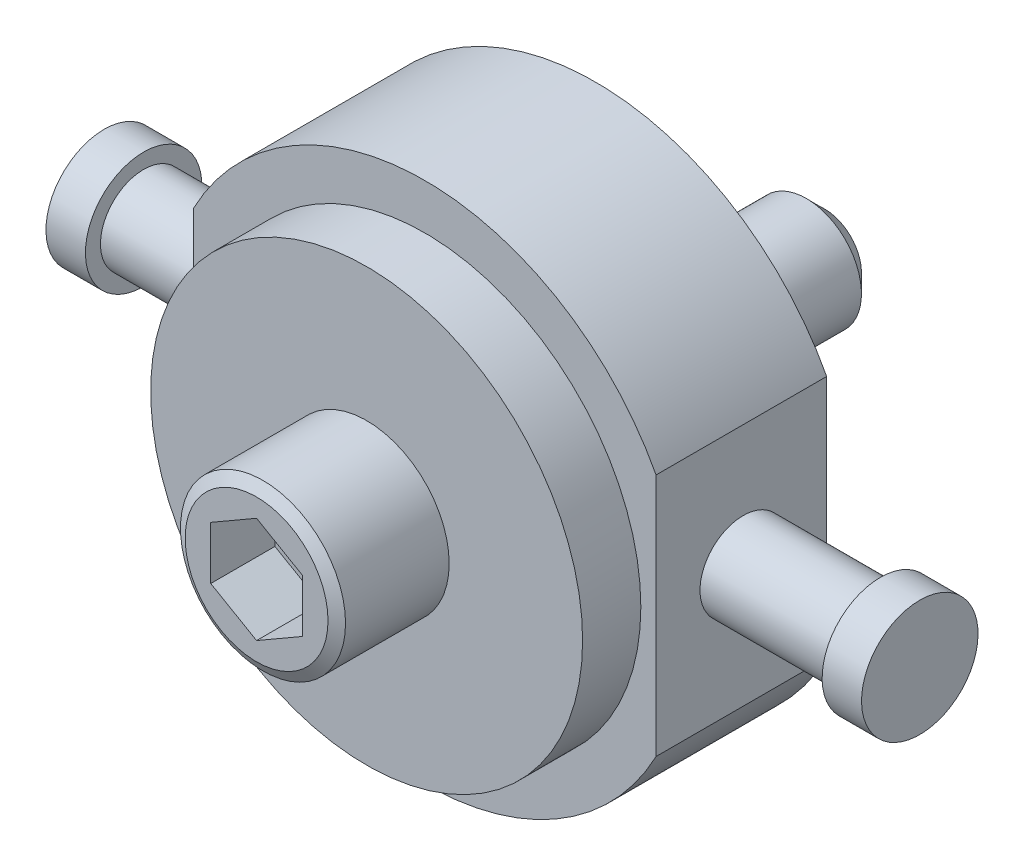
ISO-10303-21;
HEADER;
FILE_DESCRIPTION(('STEP AP214'),'2;1');
FILE_NAME('part.step','',(''),(''),'','','');
FILE_SCHEMA(('AUTOMOTIVE_DESIGN { 1 0 10303 214 1 1 1 1 }'));
ENDSEC;
DATA;
#1=APPLICATION_CONTEXT('core data for automotive mechanical design processes');
#2=APPLICATION_PROTOCOL_DEFINITION('international standard','automotive_design',2000,#1);
#3=PRODUCT_CONTEXT('',#1,'mechanical');
#4=PRODUCT('Part','Part','',(#3));
#5=PRODUCT_RELATED_PRODUCT_CATEGORY('part','',(#4));
#6=PRODUCT_DEFINITION_FORMATION('','',#4);
#7=PRODUCT_DEFINITION_CONTEXT('part definition',#1,'design');
#8=PRODUCT_DEFINITION('design','',#6,#7);
#9=PRODUCT_DEFINITION_SHAPE('','',#8);
#10=(LENGTH_UNIT() NAMED_UNIT(*) SI_UNIT(.MILLI.,.METRE.));
#11=(NAMED_UNIT(*) PLANE_ANGLE_UNIT() SI_UNIT($,.RADIAN.));
#12=(NAMED_UNIT(*) SI_UNIT($,.STERADIAN.) SOLID_ANGLE_UNIT());
#13=UNCERTAINTY_MEASURE_WITH_UNIT(LENGTH_MEASURE(1.E-05),#10,'distance_accuracy_value','');
#14=(GEOMETRIC_REPRESENTATION_CONTEXT(3) GLOBAL_UNCERTAINTY_ASSIGNED_CONTEXT((#13)) GLOBAL_UNIT_ASSIGNED_CONTEXT((#10,
#11,#12)) REPRESENTATION_CONTEXT('',''));
#15=CARTESIAN_POINT('',(0.,0.,0.));
#16=DIRECTION('',(0.,0.,1.));
#17=DIRECTION('',(1.,0.,0.));
#18=AXIS2_PLACEMENT_3D('',#15,#16,#17);
#19=CARTESIAN_POINT('',(0.,0.,0.));
#20=DIRECTION('',(0.,0.,1.));
#21=DIRECTION('',(1.,0.,0.));
#22=AXIS2_PLACEMENT_3D('',#19,#20,#21);
#23=PLANE('',#22);
#24=CARTESIAN_POINT('',(0.,0.,0.));
#25=DIRECTION('',(0.,0.,1.));
#26=DIRECTION('',(1.,0.,0.));
#27=AXIS2_PLACEMENT_3D('',#24,#25,#26);
#28=CIRCLE('',#27,18.9);
#29=CARTESIAN_POINT('',(18.9,0.,0.));
#30=VERTEX_POINT('',#29);
#31=EDGE_CURVE('E190',#30,#30,#28,.T.);
#32=ORIENTED_EDGE('',*,*,#31,.F.);
#33=EDGE_LOOP('',(#32));
#34=FACE_BOUND('',#33,.T.);
#35=CARTESIAN_POINT('',(0.,0.,0.));
#36=DIRECTION('',(0.,0.,-1.));
#37=DIRECTION('',(-1.,0.,0.));
#38=AXIS2_PLACEMENT_3D('',#35,#36,#37);
#39=CIRCLE('',#38,6.);
#40=CARTESIAN_POINT('',(-6.,0.,0.));
#41=VERTEX_POINT('',#40);
#42=EDGE_CURVE('E137',#41,#41,#39,.T.);
#43=ORIENTED_EDGE('',*,*,#42,.F.);
#44=EDGE_LOOP('',(#43));
#45=FACE_BOUND('',#44,.T.);
#46=ADVANCED_FACE('F14',(#34,#45),#23,.F.);
#47=CARTESIAN_POINT('',(40.165,0.,15.1));
#48=DIRECTION('',(1.,0.,0.));
#49=DIRECTION('',(0.,1.,0.));
#50=AXIS2_PLACEMENT_3D('',#47,#48,#49);
#51=PLANE('',#50);
#52=CARTESIAN_POINT('',(40.165,0.,15.1));
#53=DIRECTION('',(1.,0.,0.));
#54=DIRECTION('',(0.,0.,-1.));
#55=AXIS2_PLACEMENT_3D('',#52,#53,#54);
#56=CIRCLE('',#55,4.71);
#57=CARTESIAN_POINT('',(40.165,0.,10.39));
#58=VERTEX_POINT('',#57);
#59=EDGE_CURVE('E162',#58,#58,#56,.F.);
#60=ORIENTED_EDGE('',*,*,#59,.F.);
#61=EDGE_LOOP('',(#60));
#62=FACE_BOUND('',#61,.T.);
#63=CARTESIAN_POINT('',(40.165,0.,15.1));
#64=DIRECTION('',(1.,0.,0.));
#65=DIRECTION('',(0.,1.,0.));
#66=AXIS2_PLACEMENT_3D('',#63,#64,#65);
#67=CIRCLE('',#66,6.35);
#68=CARTESIAN_POINT('',(40.165,6.35,15.1));
#69=VERTEX_POINT('',#68);
#70=EDGE_CURVE('E9',#69,#69,#67,.T.);
#71=ORIENTED_EDGE('',*,*,#70,.F.);
#72=EDGE_LOOP('',(#71));
#73=FACE_BOUND('',#72,.T.);
#74=ADVANCED_FACE('F234',(#62,#73),#51,.F.);
#75=CARTESIAN_POINT('',(-40.165,0.,15.1));
#76=DIRECTION('',(1.,0.,0.));
#77=DIRECTION('',(0.,1.,0.));
#78=AXIS2_PLACEMENT_3D('',#75,#76,#77);
#79=PLANE('',#78);
#80=CARTESIAN_POINT('',(-40.165,0.,15.1));
#81=DIRECTION('',(1.,0.,0.));
#82=DIRECTION('',(0.,0.,-1.));
#83=AXIS2_PLACEMENT_3D('',#80,#81,#82);
#84=CIRCLE('',#83,4.71);
#85=CARTESIAN_POINT('',(-40.165,0.,10.39));
#86=VERTEX_POINT('',#85);
#87=EDGE_CURVE('E149',#86,#86,#84,.T.);
#88=ORIENTED_EDGE('',*,*,#87,.F.);
#89=EDGE_LOOP('',(#88));
#90=FACE_BOUND('',#89,.T.);
#91=CARTESIAN_POINT('',(-40.165,0.,15.1));
#92=DIRECTION('',(1.,0.,0.));
#93=DIRECTION('',(0.,1.,0.));
#94=AXIS2_PLACEMENT_3D('',#91,#92,#93);
#95=CIRCLE('',#94,6.35);
#96=CARTESIAN_POINT('',(-40.165,6.35,15.1));
#97=VERTEX_POINT('',#96);
#98=EDGE_CURVE('E200',#97,#97,#95,.T.);
#99=ORIENTED_EDGE('',*,*,#98,.T.);
#100=EDGE_LOOP('',(#99));
#101=FACE_BOUND('',#100,.T.);
#102=ADVANCED_FACE('F240',(#90,#101),#79,.T.);
#103=CARTESIAN_POINT('',(0.,0.,42.95));
#104=DIRECTION('',(0.,0.,-1.));
#105=DIRECTION('',(-1.,0.,0.));
#106=AXIS2_PLACEMENT_3D('',#103,#104,#105);
#107=CYLINDRICAL_SURFACE('',#106,9.);
#108=CARTESIAN_POINT('',(0.,0.,42.25));
#109=DIRECTION('',(0.,0.,1.));
#110=DIRECTION('',(1.,0.,0.));
#111=AXIS2_PLACEMENT_3D('',#108,#109,#110);
#112=CIRCLE('',#111,9.);
#113=CARTESIAN_POINT('',(9.,0.,42.25));
#114=VERTEX_POINT('',#113);
#115=EDGE_CURVE('E146',#114,#114,#112,.F.);
#116=ORIENTED_EDGE('',*,*,#115,.T.);
#117=EDGE_LOOP('',(#116));
#118=FACE_BOUND('',#117,.T.);
#119=CARTESIAN_POINT('',(0.,0.,30.95));
#120=DIRECTION('',(0.,0.,1.));
#121=DIRECTION('',(1.,0.,0.));
#122=AXIS2_PLACEMENT_3D('',#119,#120,#121);
#123=CIRCLE('',#122,9.);
#124=CARTESIAN_POINT('',(9.,0.,30.95));
#125=VERTEX_POINT('',#124);
#126=EDGE_CURVE('E142',#125,#125,#123,.T.);
#127=ORIENTED_EDGE('',*,*,#126,.T.);
#128=EDGE_LOOP('',(#127));
#129=FACE_BOUND('',#128,.T.);
#130=ADVANCED_FACE('F215',(#118,#129),#107,.T.);
#131=CARTESIAN_POINT('',(0.,0.,30.95));
#132=DIRECTION('',(0.,0.,-1.));
#133=DIRECTION('',(-1.,0.,0.));
#134=AXIS2_PLACEMENT_3D('',#131,#132,#133);
#135=CYLINDRICAL_SURFACE('',#134,23.55);
#136=CARTESIAN_POINT('',(0.,0.,30.95));
#137=DIRECTION('',(0.,0.,1.));
#138=DIRECTION('',(1.,0.,0.));
#139=AXIS2_PLACEMENT_3D('',#136,#137,#138);
#140=CIRCLE('',#139,23.55);
#141=CARTESIAN_POINT('',(23.55,0.,30.95));
#142=VERTEX_POINT('',#141);
#143=EDGE_CURVE('E150',#142,#142,#140,.T.);
#144=ORIENTED_EDGE('',*,*,#143,.F.);
#145=EDGE_LOOP('',(#144));
#146=FACE_BOUND('',#145,.T.);
#147=CARTESIAN_POINT('',(0.,0.,24.6));
#148=DIRECTION('',(0.,0.,1.));
#149=DIRECTION('',(1.,0.,0.));
#150=AXIS2_PLACEMENT_3D('',#147,#148,#149);
#151=CIRCLE('',#150,23.55);
#152=CARTESIAN_POINT('',(23.55,0.,24.6));
#153=VERTEX_POINT('',#152);
#154=EDGE_CURVE('E145',#153,#153,#151,.T.);
#155=ORIENTED_EDGE('',*,*,#154,.T.);
#156=EDGE_LOOP('',(#155));
#157=FACE_BOUND('',#156,.T.);
#158=ADVANCED_FACE('F300',(#146,#157),#135,.T.);
#159=CARTESIAN_POINT('',(-47.56,0.,15.1));
#160=DIRECTION('',(1.,0.,0.));
#161=DIRECTION('',(0.,0.,-1.));
#162=AXIS2_PLACEMENT_3D('',#159,#160,#161);
#163=CYLINDRICAL_SURFACE('',#162,4.71);
#164=ORIENTED_EDGE('',*,*,#87,.T.);
#165=EDGE_LOOP('',(#164));
#166=FACE_BOUND('',#165,.T.);
#167=CARTESIAN_POINT('',(-25.21,0.,15.1));
#168=DIRECTION('',(1.,0.,0.));
#169=DIRECTION('',(0.,0.,-1.));
#170=AXIS2_PLACEMENT_3D('',#167,#168,#169);
#171=CIRCLE('',#170,4.71);
#172=CARTESIAN_POINT('',(-25.21,0.,10.39));
#173=VERTEX_POINT('',#172);
#174=EDGE_CURVE('E155',#173,#173,#171,.T.);
#175=ORIENTED_EDGE('',*,*,#174,.F.);
#176=EDGE_LOOP('',(#175));
#177=FACE_BOUND('',#176,.T.);
#178=ADVANCED_FACE('F253',(#166,#177),#163,.T.);
#179=CARTESIAN_POINT('',(0.,0.,6.));
#180=DIRECTION('',(0.,0.,-1.));
#181=DIRECTION('',(-1.,0.,0.));
#182=AXIS2_PLACEMENT_3D('',#179,#180,#181);
#183=CYLINDRICAL_SURFACE('',#182,18.9);
#184=CARTESIAN_POINT('',(0.,0.,6.));
#185=DIRECTION('',(0.,0.,1.));
#186=DIRECTION('',(1.,0.,0.));
#187=AXIS2_PLACEMENT_3D('',#184,#185,#186);
#188=CIRCLE('',#187,18.9);
#189=CARTESIAN_POINT('',(18.9,0.,6.));
#190=VERTEX_POINT('',#189);
#191=EDGE_CURVE('E166',#190,#190,#188,.T.);
#192=ORIENTED_EDGE('',*,*,#191,.F.);
#193=EDGE_LOOP('',(#192));
#194=FACE_BOUND('',#193,.T.);
#195=ORIENTED_EDGE('',*,*,#31,.T.);
#196=EDGE_LOOP('',(#195));
#197=FACE_BOUND('',#196,.T.);
#198=ADVANCED_FACE('F249',(#194,#197),#183,.T.);
#199=CARTESIAN_POINT('',(0.,0.,24.6));
#200=DIRECTION('',(0.,0.,-1.));
#201=DIRECTION('',(-1.,0.,0.));
#202=AXIS2_PLACEMENT_3D('',#199,#200,#201);
#203=CYLINDRICAL_SURFACE('',#202,28.5);
#204=DIRECTION('',(0.,0.,-1.));
#205=VECTOR('',#204,1.);
#206=CARTESIAN_POINT('',(25.21,-13.2930771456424,24.6));
#207=LINE('',#206,#205);
#208=CARTESIAN_POINT('',(25.21,-13.2930771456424,24.6));
#209=VERTEX_POINT('',#208);
#210=CARTESIAN_POINT('',(25.21,-13.2930771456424,6.));
#211=VERTEX_POINT('',#210);
#212=EDGE_CURVE('E178',#209,#211,#207,.T.);
#213=ORIENTED_EDGE('',*,*,#212,.F.);
#214=CARTESIAN_POINT('',(0.,0.,24.6));
#215=DIRECTION('',(0.,0.,1.));
#216=DIRECTION('',(1.,0.,0.));
#217=AXIS2_PLACEMENT_3D('',#214,#215,#216);
#218=CIRCLE('',#217,28.5);
#219=CARTESIAN_POINT('',(-25.21,-13.2930771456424,24.6));
#220=VERTEX_POINT('',#219);
#221=EDGE_CURVE('E154',#220,#209,#218,.T.);
#222=ORIENTED_EDGE('',*,*,#221,.F.);
#223=DIRECTION('',(0.,0.,-1.));
#224=VECTOR('',#223,1.);
#225=CARTESIAN_POINT('',(-25.21,-13.2930771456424,24.6));
#226=LINE('',#225,#224);
#227=CARTESIAN_POINT('',(-25.21,-13.2930771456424,6.));
#228=VERTEX_POINT('',#227);
#229=EDGE_CURVE('E170',#220,#228,#226,.T.);
#230=ORIENTED_EDGE('',*,*,#229,.T.);
#231=CARTESIAN_POINT('',(0.,0.,6.));
#232=DIRECTION('',(0.,0.,1.));
#233=DIRECTION('',(1.,0.,0.));
#234=AXIS2_PLACEMENT_3D('',#231,#232,#233);
#235=CIRCLE('',#234,28.5);
#236=EDGE_CURVE('E159',#228,#211,#235,.T.);
#237=ORIENTED_EDGE('',*,*,#236,.T.);
#238=EDGE_LOOP('',(#213,#222,#230,#237));
#239=FACE_BOUND('',#238,.T.);
#240=ADVANCED_FACE('F252',(#239),#203,.T.);
#241=CARTESIAN_POINT('',(-25.21,13.2930771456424,24.6));
#242=DIRECTION('',(1.,0.,0.));
#243=DIRECTION('',(0.,0.,-1.));
#244=AXIS2_PLACEMENT_3D('',#241,#242,#243);
#245=PLANE('',#244);
#246=ORIENTED_EDGE('',*,*,#174,.T.);
#247=EDGE_LOOP('',(#246));
#248=FACE_BOUND('',#247,.T.);
#249=ORIENTED_EDGE('',*,*,#229,.F.);
#250=DIRECTION('',(0.,-1.,0.));
#251=VECTOR('',#250,1.);
#252=CARTESIAN_POINT('',(-25.21,13.2930771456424,24.6));
#253=LINE('',#252,#251);
#254=CARTESIAN_POINT('',(-25.21,13.2930771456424,24.6));
#255=VERTEX_POINT('',#254);
#256=EDGE_CURVE('E181',#255,#220,#253,.T.);
#257=ORIENTED_EDGE('',*,*,#256,.F.);
#258=DIRECTION('',(0.,0.,-1.));
#259=VECTOR('',#258,1.);
#260=CARTESIAN_POINT('',(-25.21,13.2930771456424,24.6));
#261=LINE('',#260,#259);
#262=CARTESIAN_POINT('',(-25.21,13.2930771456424,6.));
#263=VERTEX_POINT('',#262);
#264=EDGE_CURVE('E158',#255,#263,#261,.T.);
#265=ORIENTED_EDGE('',*,*,#264,.T.);
#266=DIRECTION('',(0.,-1.,0.));
#267=VECTOR('',#266,1.);
#268=CARTESIAN_POINT('',(-25.21,13.2930771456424,6.));
#269=LINE('',#268,#267);
#270=EDGE_CURVE('E171',#263,#228,#269,.T.);
#271=ORIENTED_EDGE('',*,*,#270,.T.);
#272=EDGE_LOOP('',(#249,#257,#265,#271));
#273=FACE_BOUND('',#272,.T.);
#274=ADVANCED_FACE('F247',(#248,#273),#245,.F.);
#275=CARTESIAN_POINT('',(0.,0.,24.6));
#276=DIRECTION('',(0.,0.,-1.));
#277=DIRECTION('',(-1.,0.,0.));
#278=AXIS2_PLACEMENT_3D('',#275,#276,#277);
#279=CYLINDRICAL_SURFACE('',#278,28.5);
#280=ORIENTED_EDGE('',*,*,#264,.F.);
#281=CARTESIAN_POINT('',(0.,0.,24.6));
#282=DIRECTION('',(0.,0.,1.));
#283=DIRECTION('',(1.,0.,0.));
#284=AXIS2_PLACEMENT_3D('',#281,#282,#283);
#285=CIRCLE('',#284,28.5);
#286=CARTESIAN_POINT('',(25.21,13.2930771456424,24.6));
#287=VERTEX_POINT('',#286);
#288=EDGE_CURVE('E184',#287,#255,#285,.T.);
#289=ORIENTED_EDGE('',*,*,#288,.F.);
#290=DIRECTION('',(0.,0.,-1.));
#291=VECTOR('',#290,1.);
#292=CARTESIAN_POINT('',(25.21,13.2930771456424,24.6));
#293=LINE('',#292,#291);
#294=CARTESIAN_POINT('',(25.21,13.2930771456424,6.));
#295=VERTEX_POINT('',#294);
#296=EDGE_CURVE('E67',#287,#295,#293,.T.);
#297=ORIENTED_EDGE('',*,*,#296,.T.);
#298=CARTESIAN_POINT('',(0.,0.,6.));
#299=DIRECTION('',(0.,0.,1.));
#300=DIRECTION('',(1.,0.,0.));
#301=AXIS2_PLACEMENT_3D('',#298,#299,#300);
#302=CIRCLE('',#301,28.5);
#303=EDGE_CURVE('E167',#295,#263,#302,.T.);
#304=ORIENTED_EDGE('',*,*,#303,.T.);
#305=EDGE_LOOP('',(#280,#289,#297,#304));
#306=FACE_BOUND('',#305,.T.);
#307=ADVANCED_FACE('F315',(#306),#279,.T.);
#308=CARTESIAN_POINT('',(0.,0.,6.));
#309=DIRECTION('',(0.,0.,1.));
#310=DIRECTION('',(1.,0.,0.));
#311=AXIS2_PLACEMENT_3D('',#308,#309,#310);
#312=PLANE('',#311);
#313=ORIENTED_EDGE('',*,*,#303,.F.);
#314=DIRECTION('',(0.,-1.,0.));
#315=VECTOR('',#314,1.);
#316=CARTESIAN_POINT('',(25.21,13.2930771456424,6.));
#317=LINE('',#316,#315);
#318=EDGE_CURVE('E163',#295,#211,#317,.T.);
#319=ORIENTED_EDGE('',*,*,#318,.T.);
#320=ORIENTED_EDGE('',*,*,#236,.F.);
#321=ORIENTED_EDGE('',*,*,#270,.F.);
#322=EDGE_LOOP('',(#313,#319,#320,#321));
#323=FACE_BOUND('',#322,.T.);
#324=ORIENTED_EDGE('',*,*,#191,.T.);
#325=EDGE_LOOP('',(#324));
#326=FACE_BOUND('',#325,.T.);
#327=ADVANCED_FACE('F311',(#323,#326),#312,.F.);
#328=CARTESIAN_POINT('',(25.21,13.2930771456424,24.6));
#329=DIRECTION('',(1.,0.,0.));
#330=DIRECTION('',(0.,0.,-1.));
#331=AXIS2_PLACEMENT_3D('',#328,#329,#330);
#332=PLANE('',#331);
#333=DIRECTION('',(0.,-1.,0.));
#334=VECTOR('',#333,1.);
#335=CARTESIAN_POINT('',(25.21,13.2930771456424,24.6));
#336=LINE('',#335,#334);
#337=EDGE_CURVE('E176',#287,#209,#336,.T.);
#338=ORIENTED_EDGE('',*,*,#337,.T.);
#339=ORIENTED_EDGE('',*,*,#212,.T.);
#340=ORIENTED_EDGE('',*,*,#318,.F.);
#341=ORIENTED_EDGE('',*,*,#296,.F.);
#342=EDGE_LOOP('',(#338,#339,#340,#341));
#343=FACE_BOUND('',#342,.T.);
#344=CARTESIAN_POINT('',(25.21,0.,15.1));
#345=DIRECTION('',(1.,0.,0.));
#346=DIRECTION('',(0.,0.,-1.));
#347=AXIS2_PLACEMENT_3D('',#344,#345,#346);
#348=CIRCLE('',#347,4.71);
#349=CARTESIAN_POINT('',(25.21,0.,10.39));
#350=VERTEX_POINT('',#349);
#351=EDGE_CURVE('E153',#350,#350,#348,.T.);
#352=ORIENTED_EDGE('',*,*,#351,.F.);
#353=EDGE_LOOP('',(#352));
#354=FACE_BOUND('',#353,.T.);
#355=ADVANCED_FACE('F314',(#343,#354),#332,.T.);
#356=CARTESIAN_POINT('',(0.,0.,24.6));
#357=DIRECTION('',(0.,0.,1.));
#358=DIRECTION('',(1.,0.,0.));
#359=AXIS2_PLACEMENT_3D('',#356,#357,#358);
#360=PLANE('',#359);
#361=ORIENTED_EDGE('',*,*,#288,.T.);
#362=ORIENTED_EDGE('',*,*,#256,.T.);
#363=ORIENTED_EDGE('',*,*,#221,.T.);
#364=ORIENTED_EDGE('',*,*,#337,.F.);
#365=EDGE_LOOP('',(#361,#362,#363,#364));
#366=FACE_BOUND('',#365,.T.);
#367=ORIENTED_EDGE('',*,*,#154,.F.);
#368=EDGE_LOOP('',(#367));
#369=FACE_BOUND('',#368,.T.);
#370=ADVANCED_FACE('F303',(#366,#369),#360,.T.);
#371=CARTESIAN_POINT('',(0.,0.,30.95));
#372=DIRECTION('',(0.,0.,1.));
#373=DIRECTION('',(1.,0.,0.));
#374=AXIS2_PLACEMENT_3D('',#371,#372,#373);
#375=PLANE('',#374);
#376=ORIENTED_EDGE('',*,*,#143,.T.);
#377=EDGE_LOOP('',(#376));
#378=FACE_BOUND('',#377,.T.);
#379=ORIENTED_EDGE('',*,*,#126,.F.);
#380=EDGE_LOOP('',(#379));
#381=FACE_BOUND('',#380,.T.);
#382=ADVANCED_FACE('F292',(#378,#381),#375,.T.);
#383=CARTESIAN_POINT('',(47.56,0.,15.1));
#384=DIRECTION('',(-1.,0.,0.));
#385=DIRECTION('',(0.,0.,1.));
#386=AXIS2_PLACEMENT_3D('',#383,#384,#385);
#387=CYLINDRICAL_SURFACE('',#386,4.71);
#388=ORIENTED_EDGE('',*,*,#351,.T.);
#389=EDGE_LOOP('',(#388));
#390=FACE_BOUND('',#389,.T.);
#391=ORIENTED_EDGE('',*,*,#59,.T.);
#392=EDGE_LOOP('',(#391));
#393=FACE_BOUND('',#392,.T.);
#394=ADVANCED_FACE('F283',(#390,#393),#387,.T.);
#395=CARTESIAN_POINT('',(0.,0.,-19.));
#396=DIRECTION('',(0.,0.,1.));
#397=DIRECTION('',(1.,0.,0.));
#398=AXIS2_PLACEMENT_3D('',#395,#396,#397);
#399=CYLINDRICAL_SURFACE('',#398,6.);
#400=CARTESIAN_POINT('',(0.,0.,-17.));
#401=DIRECTION('',(0.,0.,-1.));
#402=DIRECTION('',(-1.,0.,0.));
#403=AXIS2_PLACEMENT_3D('',#400,#401,#402);
#404=CIRCLE('',#403,6.);
#405=CARTESIAN_POINT('',(-6.,0.,-17.));
#406=VERTEX_POINT('',#405);
#407=EDGE_CURVE('E141',#406,#406,#404,.F.);
#408=ORIENTED_EDGE('',*,*,#407,.T.);
#409=EDGE_LOOP('',(#408));
#410=FACE_BOUND('',#409,.T.);
#411=ORIENTED_EDGE('',*,*,#42,.T.);
#412=EDGE_LOOP('',(#411));
#413=FACE_BOUND('',#412,.T.);
#414=ADVANCED_FACE('F273',(#410,#413),#399,.T.);
#415=CARTESIAN_POINT('',(0.,0.,-19.));
#416=DIRECTION('',(0.,0.,-1.));
#417=DIRECTION('',(-1.,0.,0.));
#418=AXIS2_PLACEMENT_3D('',#415,#416,#417);
#419=PLANE('',#418);
#420=CARTESIAN_POINT('',(0.,0.,-19.));
#421=DIRECTION('',(0.,0.,-1.));
#422=DIRECTION('',(-1.,0.,0.));
#423=AXIS2_PLACEMENT_3D('',#420,#421,#422);
#424=CIRCLE('',#423,4.);
#425=CARTESIAN_POINT('',(-4.,0.,-19.));
#426=VERTEX_POINT('',#425);
#427=EDGE_CURVE('E140',#426,#426,#424,.T.);
#428=ORIENTED_EDGE('',*,*,#427,.T.);
#429=EDGE_LOOP('',(#428));
#430=FACE_BOUND('',#429,.T.);
#431=ADVANCED_FACE('F271',(#430),#419,.T.);
#432=CARTESIAN_POINT('',(0.,0.,-19.));
#433=DIRECTION('',(0.,0.,1.));
#434=DIRECTION('',(1.,0.,0.));
#435=AXIS2_PLACEMENT_3D('',#432,#433,#434);
#436=CONICAL_SURFACE('',#435,4.,0.78539816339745);
#437=ORIENTED_EDGE('',*,*,#407,.F.);
#438=EDGE_LOOP('',(#437));
#439=FACE_BOUND('',#438,.T.);
#440=ORIENTED_EDGE('',*,*,#427,.F.);
#441=EDGE_LOOP('',(#440));
#442=FACE_BOUND('',#441,.T.);
#443=ADVANCED_FACE('F268',(#439,#442),#436,.T.);
#444=CARTESIAN_POINT('',(0.,5.77350269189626,35.95));
#445=DIRECTION('',(0.,0.,1.));
#446=DIRECTION('',(1.,0.,0.));
#447=AXIS2_PLACEMENT_3D('',#444,#445,#446);
#448=PLANE('',#447);
#449=DIRECTION('',(-0.866025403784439,0.5,0.));
#450=VECTOR('',#449,1.);
#451=CARTESIAN_POINT('',(5.,2.88675134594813,35.95));
#452=LINE('',#451,#450);
#453=CARTESIAN_POINT('',(5.,2.88675134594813,35.95));
#454=VERTEX_POINT('',#453);
#455=CARTESIAN_POINT('',(0.,5.77350269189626,35.95));
#456=VERTEX_POINT('',#455);
#457=EDGE_CURVE('E210',#454,#456,#452,.T.);
#458=ORIENTED_EDGE('',*,*,#457,.T.);
#459=DIRECTION('',(-0.866025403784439,-0.5,0.));
#460=VECTOR('',#459,1.);
#461=CARTESIAN_POINT('',(0.,5.77350269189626,35.95));
#462=LINE('',#461,#460);
#463=CARTESIAN_POINT('',(-5.,2.88675134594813,35.95));
#464=VERTEX_POINT('',#463);
#465=EDGE_CURVE('E553',#456,#464,#462,.T.);
#466=ORIENTED_EDGE('',*,*,#465,.T.);
#467=DIRECTION('',(0.,-1.,0.));
#468=VECTOR('',#467,1.);
#469=CARTESIAN_POINT('',(-5.,2.88675134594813,35.95));
#470=LINE('',#469,#468);
#471=CARTESIAN_POINT('',(-5.,-2.88675134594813,35.95));
#472=VERTEX_POINT('',#471);
#473=EDGE_CURVE('E560',#464,#472,#470,.T.);
#474=ORIENTED_EDGE('',*,*,#473,.T.);
#475=DIRECTION('',(0.866025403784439,-0.5,0.));
#476=VECTOR('',#475,1.);
#477=CARTESIAN_POINT('',(-5.,-2.88675134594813,35.95));
#478=LINE('',#477,#476);
#479=CARTESIAN_POINT('',(0.,-5.77350269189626,35.95));
#480=VERTEX_POINT('',#479);
#481=EDGE_CURVE('E561',#472,#480,#478,.T.);
#482=ORIENTED_EDGE('',*,*,#481,.T.);
#483=DIRECTION('',(0.866025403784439,0.5,0.));
#484=VECTOR('',#483,1.);
#485=CARTESIAN_POINT('',(0.,-5.77350269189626,35.95));
#486=LINE('',#485,#484);
#487=CARTESIAN_POINT('',(5.,-2.88675134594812,35.95));
#488=VERTEX_POINT('',#487);
#489=EDGE_CURVE('E105',#480,#488,#486,.T.);
#490=ORIENTED_EDGE('',*,*,#489,.T.);
#491=DIRECTION('',(0.,1.,0.));
#492=VECTOR('',#491,1.);
#493=CARTESIAN_POINT('',(5.,-2.88675134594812,35.95));
#494=LINE('',#493,#492);
#495=EDGE_CURVE('E555',#488,#454,#494,.T.);
#496=ORIENTED_EDGE('',*,*,#495,.T.);
#497=EDGE_LOOP('',(#458,#466,#474,#482,#490,#496));
#498=FACE_BOUND('',#497,.T.);
#499=ADVANCED_FACE('F270',(#498),#448,.T.);
#500=CARTESIAN_POINT('',(0.,5.77350269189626,35.95));
#501=DIRECTION('',(-0.5,0.866025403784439,0.));
#502=DIRECTION('',(-0.866025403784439,-0.5,0.));
#503=AXIS2_PLACEMENT_3D('',#500,#501,#502);
#504=PLANE('',#503);
#505=DIRECTION('',(-0.866025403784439,-0.5,0.));
#506=VECTOR('',#505,1.);
#507=CARTESIAN_POINT('',(0.,5.77350269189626,42.95));
#508=LINE('',#507,#506);
#509=CARTESIAN_POINT('',(0.,5.77350269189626,42.95));
#510=VERTEX_POINT('',#509);
#511=CARTESIAN_POINT('',(-5.,2.88675134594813,42.95));
#512=VERTEX_POINT('',#511);
#513=EDGE_CURVE('E136',#510,#512,#508,.T.);
#514=ORIENTED_EDGE('',*,*,#513,.T.);
#515=DIRECTION('',(0.,0.,1.));
#516=VECTOR('',#515,1.);
#517=CARTESIAN_POINT('',(-5.,2.88675134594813,35.95));
#518=LINE('',#517,#516);
#519=EDGE_CURVE('E76',#464,#512,#518,.T.);
#520=ORIENTED_EDGE('',*,*,#519,.F.);
#521=ORIENTED_EDGE('',*,*,#465,.F.);
#522=DIRECTION('',(0.,0.,1.));
#523=VECTOR('',#522,1.);
#524=CARTESIAN_POINT('',(0.,5.77350269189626,35.95));
#525=LINE('',#524,#523);
#526=EDGE_CURVE('E133',#456,#510,#525,.T.);
#527=ORIENTED_EDGE('',*,*,#526,.T.);
#528=EDGE_LOOP('',(#514,#520,#521,#527));
#529=FACE_BOUND('',#528,.T.);
#530=ADVANCED_FACE('F278',(#529),#504,.F.);
#531=CARTESIAN_POINT('',(-5.,2.88675134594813,35.95));
#532=DIRECTION('',(-1.,0.,0.));
#533=DIRECTION('',(0.,-1.,0.));
#534=AXIS2_PLACEMENT_3D('',#531,#532,#533);
#535=PLANE('',#534);
#536=DIRECTION('',(0.,-1.,0.));
#537=VECTOR('',#536,1.);
#538=CARTESIAN_POINT('',(-5.,2.88675134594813,42.95));
#539=LINE('',#538,#537);
#540=CARTESIAN_POINT('',(-5.,-2.88675134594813,42.95));
#541=VERTEX_POINT('',#540);
#542=EDGE_CURVE('E132',#512,#541,#539,.T.);
#543=ORIENTED_EDGE('',*,*,#542,.T.);
#544=DIRECTION('',(0.,0.,1.));
#545=VECTOR('',#544,1.);
#546=CARTESIAN_POINT('',(-5.,-2.88675134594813,35.95));
#547=LINE('',#546,#545);
#548=EDGE_CURVE('E114',#472,#541,#547,.T.);
#549=ORIENTED_EDGE('',*,*,#548,.F.);
#550=ORIENTED_EDGE('',*,*,#473,.F.);
#551=ORIENTED_EDGE('',*,*,#519,.T.);
#552=EDGE_LOOP('',(#543,#549,#550,#551));
#553=FACE_BOUND('',#552,.T.);
#554=ADVANCED_FACE('F421',(#553),#535,.F.);
#555=CARTESIAN_POINT('',(-5.,-2.88675134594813,35.95));
#556=DIRECTION('',(-0.5,-0.866025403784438,0.));
#557=DIRECTION('',(0.866025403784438,-0.5,0.));
#558=AXIS2_PLACEMENT_3D('',#555,#556,#557);
#559=PLANE('',#558);
#560=DIRECTION('',(0.866025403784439,-0.5,0.));
#561=VECTOR('',#560,1.);
#562=CARTESIAN_POINT('',(-5.,-2.88675134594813,42.95));
#563=LINE('',#562,#561);
#564=CARTESIAN_POINT('',(0.,-5.77350269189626,42.95));
#565=VERTEX_POINT('',#564);
#566=EDGE_CURVE('E112',#541,#565,#563,.T.);
#567=ORIENTED_EDGE('',*,*,#566,.T.);
#568=DIRECTION('',(0.,0.,1.));
#569=VECTOR('',#568,1.);
#570=CARTESIAN_POINT('',(0.,-5.77350269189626,35.95));
#571=LINE('',#570,#569);
#572=EDGE_CURVE('E98',#480,#565,#571,.T.);
#573=ORIENTED_EDGE('',*,*,#572,.F.);
#574=ORIENTED_EDGE('',*,*,#481,.F.);
#575=ORIENTED_EDGE('',*,*,#548,.T.);
#576=EDGE_LOOP('',(#567,#573,#574,#575));
#577=FACE_BOUND('',#576,.T.);
#578=ADVANCED_FACE('F113',(#577),#559,.F.);
#579=CARTESIAN_POINT('',(0.,-5.77350269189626,35.95));
#580=DIRECTION('',(0.5,-0.866025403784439,0.));
#581=DIRECTION('',(0.866025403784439,0.5,0.));
#582=AXIS2_PLACEMENT_3D('',#579,#580,#581);
#583=PLANE('',#582);
#584=DIRECTION('',(0.866025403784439,0.5,0.));
#585=VECTOR('',#584,1.);
#586=CARTESIAN_POINT('',(0.,-5.77350269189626,42.95));
#587=LINE('',#586,#585);
#588=CARTESIAN_POINT('',(5.,-2.88675134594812,42.95));
#589=VERTEX_POINT('',#588);
#590=EDGE_CURVE('E102',#565,#589,#587,.T.);
#591=ORIENTED_EDGE('',*,*,#590,.T.);
#592=DIRECTION('',(0.,0.,1.));
#593=VECTOR('',#592,1.);
#594=CARTESIAN_POINT('',(5.,-2.88675134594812,35.95));
#595=LINE('',#594,#593);
#596=EDGE_CURVE('E126',#488,#589,#595,.T.);
#597=ORIENTED_EDGE('',*,*,#596,.F.);
#598=ORIENTED_EDGE('',*,*,#489,.F.);
#599=ORIENTED_EDGE('',*,*,#572,.T.);
#600=EDGE_LOOP('',(#591,#597,#598,#599));
#601=FACE_BOUND('',#600,.T.);
#602=ADVANCED_FACE('F100',(#601),#583,.F.);
#603=CARTESIAN_POINT('',(5.,-2.88675134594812,35.95));
#604=DIRECTION('',(1.,0.,0.));
#605=DIRECTION('',(0.,1.,0.));
#606=AXIS2_PLACEMENT_3D('',#603,#604,#605);
#607=PLANE('',#606);
#608=DIRECTION('',(0.,1.,0.));
#609=VECTOR('',#608,1.);
#610=CARTESIAN_POINT('',(5.,-2.88675134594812,42.95));
#611=LINE('',#610,#609);
#612=CARTESIAN_POINT('',(5.,2.88675134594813,42.95));
#613=VERTEX_POINT('',#612);
#614=EDGE_CURVE('E109',#589,#613,#611,.T.);
#615=ORIENTED_EDGE('',*,*,#614,.T.);
#616=DIRECTION('',(0.,0.,1.));
#617=VECTOR('',#616,1.);
#618=CARTESIAN_POINT('',(5.,2.88675134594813,35.95));
#619=LINE('',#618,#617);
#620=EDGE_CURVE('E33',#454,#613,#619,.T.);
#621=ORIENTED_EDGE('',*,*,#620,.F.);
#622=ORIENTED_EDGE('',*,*,#495,.F.);
#623=ORIENTED_EDGE('',*,*,#596,.T.);
#624=EDGE_LOOP('',(#615,#621,#622,#623));
#625=FACE_BOUND('',#624,.T.);
#626=ADVANCED_FACE('F447',(#625),#607,.F.);
#627=CARTESIAN_POINT('',(5.,2.88675134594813,35.95));
#628=DIRECTION('',(0.5,0.866025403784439,0.));
#629=DIRECTION('',(-0.866025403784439,0.5,0.));
#630=AXIS2_PLACEMENT_3D('',#627,#628,#629);
#631=PLANE('',#630);
#632=DIRECTION('',(-0.866025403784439,0.5,0.));
#633=VECTOR('',#632,1.);
#634=CARTESIAN_POINT('',(5.,2.88675134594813,42.95));
#635=LINE('',#634,#633);
#636=EDGE_CURVE('E128',#613,#510,#635,.T.);
#637=ORIENTED_EDGE('',*,*,#636,.T.);
#638=ORIENTED_EDGE('',*,*,#526,.F.);
#639=ORIENTED_EDGE('',*,*,#457,.F.);
#640=ORIENTED_EDGE('',*,*,#620,.T.);
#641=EDGE_LOOP('',(#637,#638,#639,#640));
#642=FACE_BOUND('',#641,.T.);
#643=ADVANCED_FACE('F229',(#642),#631,.F.);
#644=CARTESIAN_POINT('',(0.,0.,42.95));
#645=DIRECTION('',(0.,0.,1.));
#646=DIRECTION('',(1.,0.,0.));
#647=AXIS2_PLACEMENT_3D('',#644,#645,#646);
#648=PLANE('',#647);
#649=CARTESIAN_POINT('',(0.,0.,42.95));
#650=DIRECTION('',(0.,0.,1.));
#651=DIRECTION('',(1.,0.,0.));
#652=AXIS2_PLACEMENT_3D('',#649,#650,#651);
#653=CIRCLE('',#652,7.7875644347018);
#654=CARTESIAN_POINT('',(7.7875644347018,0.,42.95));
#655=VERTEX_POINT('',#654);
#656=EDGE_CURVE('E18',#655,#655,#653,.T.);
#657=ORIENTED_EDGE('',*,*,#656,.T.);
#658=EDGE_LOOP('',(#657));
#659=FACE_BOUND('',#658,.T.);
#660=ORIENTED_EDGE('',*,*,#636,.F.);
#661=ORIENTED_EDGE('',*,*,#614,.F.);
#662=ORIENTED_EDGE('',*,*,#590,.F.);
#663=ORIENTED_EDGE('',*,*,#566,.F.);
#664=ORIENTED_EDGE('',*,*,#542,.F.);
#665=ORIENTED_EDGE('',*,*,#513,.F.);
#666=EDGE_LOOP('',(#660,#661,#662,#663,#664,#665));
#667=FACE_BOUND('',#666,.T.);
#668=ADVANCED_FACE('F120',(#659,#667),#648,.T.);
#669=CARTESIAN_POINT('',(0.,0.,42.25));
#670=DIRECTION('',(0.,0.,-1.));
#671=DIRECTION('',(-1.,0.,0.));
#672=AXIS2_PLACEMENT_3D('',#669,#670,#671);
#673=CONICAL_SURFACE('',#672,9.,1.0471975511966);
#674=ORIENTED_EDGE('',*,*,#656,.F.);
#675=EDGE_LOOP('',(#674));
#676=FACE_BOUND('',#675,.T.);
#677=ORIENTED_EDGE('',*,*,#115,.F.);
#678=EDGE_LOOP('',(#677));
#679=FACE_BOUND('',#678,.T.);
#680=ADVANCED_FACE('F16',(#676,#679),#673,.T.);
#681=CARTESIAN_POINT('',(-44.465,0.,15.1));
#682=DIRECTION('',(1.,0.,0.));
#683=DIRECTION('',(0.,1.,0.));
#684=AXIS2_PLACEMENT_3D('',#681,#682,#683);
#685=PLANE('',#684);
#686=CARTESIAN_POINT('',(-44.465,0.,15.1));
#687=DIRECTION('',(1.,0.,0.));
#688=DIRECTION('',(0.,1.,0.));
#689=AXIS2_PLACEMENT_3D('',#686,#687,#688);
#690=CIRCLE('',#689,6.35);
#691=CARTESIAN_POINT('',(-44.465,6.35,15.1));
#692=VERTEX_POINT('',#691);
#693=EDGE_CURVE('E203',#692,#692,#690,.T.);
#694=ORIENTED_EDGE('',*,*,#693,.F.);
#695=EDGE_LOOP('',(#694));
#696=FACE_BOUND('',#695,.T.);
#697=ADVANCED_FACE('F219',(#696),#685,.F.);
#698=CARTESIAN_POINT('',(-44.465,0.,15.1));
#699=DIRECTION('',(1.,0.,0.));
#700=DIRECTION('',(0.,1.,0.));
#701=AXIS2_PLACEMENT_3D('',#698,#699,#700);
#702=CYLINDRICAL_SURFACE('',#701,6.35);
#703=ORIENTED_EDGE('',*,*,#693,.T.);
#704=EDGE_LOOP('',(#703));
#705=FACE_BOUND('',#704,.T.);
#706=ORIENTED_EDGE('',*,*,#98,.F.);
#707=EDGE_LOOP('',(#706));
#708=FACE_BOUND('',#707,.T.);
#709=ADVANCED_FACE('F226',(#705,#708),#702,.T.);
#710=CARTESIAN_POINT('',(44.465,0.,15.1));
#711=DIRECTION('',(1.,0.,0.));
#712=DIRECTION('',(0.,1.,0.));
#713=AXIS2_PLACEMENT_3D('',#710,#711,#712);
#714=PLANE('',#713);
#715=CARTESIAN_POINT('',(44.465,0.,15.1));
#716=DIRECTION('',(1.,0.,0.));
#717=DIRECTION('',(0.,1.,0.));
#718=AXIS2_PLACEMENT_3D('',#715,#716,#717);
#719=CIRCLE('',#718,6.35);
#720=CARTESIAN_POINT('',(44.465,6.35,15.1));
#721=VERTEX_POINT('',#720);
#722=EDGE_CURVE('E24',#721,#721,#719,.T.);
#723=ORIENTED_EDGE('',*,*,#722,.T.);
#724=EDGE_LOOP('',(#723));
#725=FACE_BOUND('',#724,.T.);
#726=ADVANCED_FACE('F259',(#725),#714,.T.);
#727=CARTESIAN_POINT('',(44.465,0.,15.1));
#728=DIRECTION('',(-1.,0.,0.));
#729=DIRECTION('',(0.,-1.,0.));
#730=AXIS2_PLACEMENT_3D('',#727,#728,#729);
#731=CYLINDRICAL_SURFACE('',#730,6.35);
#732=ORIENTED_EDGE('',*,*,#722,.F.);
#733=EDGE_LOOP('',(#732));
#734=FACE_BOUND('',#733,.T.);
#735=ORIENTED_EDGE('',*,*,#70,.T.);
#736=EDGE_LOOP('',(#735));
#737=FACE_BOUND('',#736,.T.);
#738=ADVANCED_FACE('F264',(#734,#737),#731,.T.);
#739=CLOSED_SHELL('',(#46,#74,#102,#130,#158,#178,#198,#240,#274,#307,#327,#355,#370,#382,#394,
#414,#431,#443,#499,#530,#554,#578,#602,#626,#643,#668,#680,#697,#709,#726,#738));
#740=MANIFOLD_SOLID_BREP('B1',#739);
#741=ADVANCED_BREP_SHAPE_REPRESENTATION('',(#18,#740),#14);
#742=SHAPE_DEFINITION_REPRESENTATION(#9,#741);
ENDSEC;
END-ISO-10303-21;
